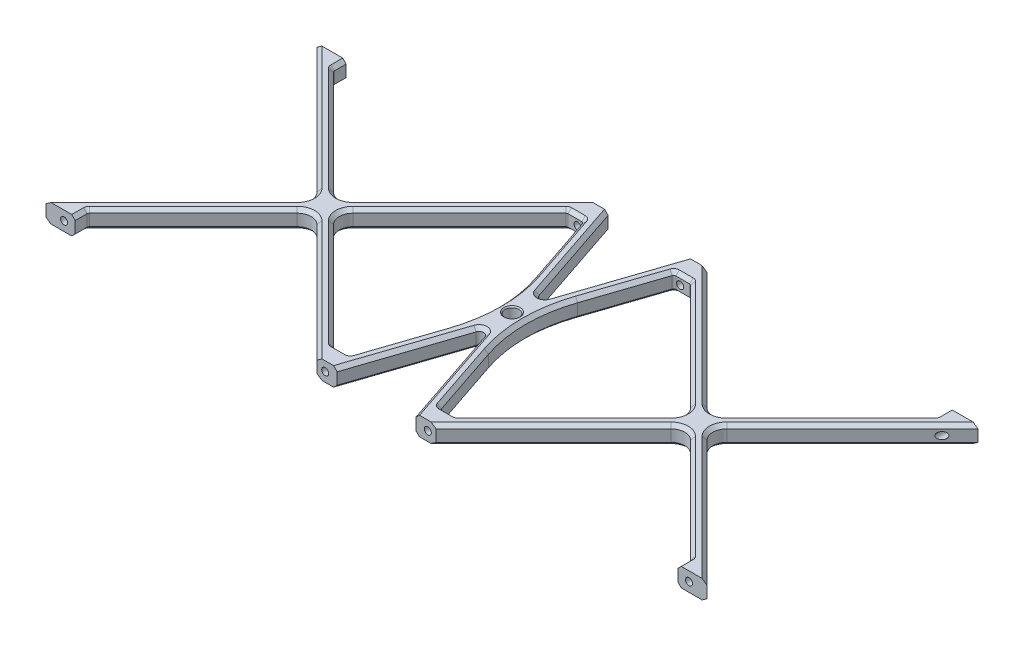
from build123d import *

# Parameters (mm, degrees)
AUFSATZ_LINEAR_AUSTRAGEN1_DEPTH      = 4
AUFSATZ_LINEAR_AUSTRAGEN1_DEPTH_BACK = 4
SKIZZE1_W                            = 284
SKIZZE1_H                            = 116.2
SKIZZE2_R                            = 1.5
SCHNITT_LINEAR_AUSTRAGEN1_DEPTH      = 10
SCHNITT_LINEAR_AUSTRAGEN2_DEPTH      = 154.478369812
SCHNITT_LINEAR_AUSTRAGEN2_DEPTH_BACK = 154.478369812
SKIZZE3_R                            = 1.5
VERRUNDUNG1_R                        = 1
FASE2_SIZE                           = 1.5
SKIZZE4_R                            = 3
SCHNITT_LINEAR_AUSTRAGEN3_DEPTH      = 5
FASE3_SIZE                           = 0.5


with BuildPart() as part:
    # Skizze1 → Aufsatz-Linear austragen1 (new, two sides: drawn at the far end of the back side and taken through both)
    with BuildSketch(Plane(origin=(0, 0, 0), x_dir=(1, 0, 0), z_dir=(0, 1, 0)).offset(-AUFSATZ_LINEAR_AUSTRAGEN1_DEPTH_BACK)):
        Rectangle(SKIZZE1_W, SKIZZE1_H)
    extrude(amount=AUFSATZ_LINEAR_AUSTRAGEN1_DEPTH + AUFSATZ_LINEAR_AUSTRAGEN1_DEPTH_BACK)

    # Skizze2 → Schnitt-Linear austragen1 (cut)
    with BuildSketch(Plane.XY.offset(58.1)):
        with Locations((-134, 0)):
            Circle(SKIZZE2_R)
        with Locations((-22, 0)):
            Circle(SKIZZE2_R)
        with Locations(Location((22, 0, 0), (0, 0, 180))):
            Circle(SKIZZE2_R)
        with Locations(Location((134, 0, 0), (0, 0, 180))):
            Circle(SKIZZE2_R)
    schnitt_linear_austragen1 = extrude(amount=-SCHNITT_LINEAR_AUSTRAGEN1_DEPTH, mode=Mode.SUBTRACT)

    # Spiegeln1: Schnitt-Linear austragen1 across plane
    add(schnitt_linear_austragen1.mirror(Plane.XY), mode=Mode.SUBTRACT)

    # Skizze3 → Schnitt-Linear austragen2 (cut, two sides: drawn at the far end of the back side and taken through both)
    with BuildSketch(Plane(origin=(0, 0, 0), x_dir=(1, 0, 0), z_dir=(0, 1, 0)).offset(-SCHNITT_LINEAR_AUSTRAGEN2_DEPTH_BACK)):
        with Locations(Location((0, 0, 0), (0, 0, 270))):
            Circle(SKIZZE3_R)
        with BuildLine():
            Line((-142, 58.364466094), (-87.878174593, 4.242640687))
            ThreePointArc((-87.878174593, 4.242640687), (-86.12081528, 0), (-87.878174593, -4.242640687))
            Line((-87.878174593, -4.242640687), (-142, -58.364466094))
            Line((-142, -58.364466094), (-142, 58.364466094))
        make_face()
        with BuildLine():
            Line((-129.2, 52.635533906), (-84.342640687, 7.778174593))
            ThreePointArc((-84.342640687, 7.778174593), (-80.1, 6.02081528), (-75.857359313, 7.778174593))
            Line((-75.857359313, 7.778174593), (-25.535533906, 58.1))
            Line((-25.535533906, 58.1), (-129.2, 58.1))
            Line((-129.2, 58.1), (-129.2, 52.635533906))
        make_face()
        with BuildLine():
            Line((-25.535533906, -58.1), (-129.2, -58.1))
            Line((-129.2, -58.1), (-129.2, -52.635533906))
            Line((-129.2, -52.635533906), (-84.342640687, -7.778174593))
            ThreePointArc((-84.342640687, -7.778174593), (-80.1, -6.02081528), (-75.857359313, -7.778174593))
            Line((-75.857359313, -7.778174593), (-25.535533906, -58.1))
        make_face()
        with BuildLine():
            Line((-26.464466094, 50.1), (-72.321825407, 4.242640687))
            ThreePointArc((-72.321825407, 4.242640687), (-74.07918472, 0), (-72.321825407, -4.242640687))
            Line((-72.321825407, -4.242640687), (-26.464466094, -50.1))
            Line((-26.464466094, -50.1), (-19.452025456, -50.1))
            Line((-19.452025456, -50.1), (-9.044566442, -19.091109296))
            ThreePointArc((-9.044566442, -19.091109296), (-5.926281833, 0), (-9.044566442, 19.091109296))
            Line((-9.044566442, 19.091109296), (-19.452025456, 50.1))
            Line((-19.452025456, 50.1), (-26.464466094, 50.1))
        make_face()
        with BuildLine():
            Line((-16.862948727, 58.1), (-1.89605718, 13.506338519))
            ThreePointArc((-1.89605718, 13.506338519), (0, 12.142708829), (1.89605718, 13.506338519))
            Line((1.89605718, 13.506338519), (16.862948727, 58.1))
            Line((16.862948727, 58.1), (-16.862948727, 58.1))
        make_face()
        with BuildLine():
            Line((16.862948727, -58.1), (1.89605718, -13.506338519))
            ThreePointArc((1.89605718, -13.506338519), (0, -12.142708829), (-1.89605718, -13.506338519))
            Line((-1.89605718, -13.506338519), (-16.862948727, -58.1))
            Line((-16.862948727, -58.1), (16.862948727, -58.1))
        make_face()
        with BuildLine():
            Line((26.464466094, -50.1), (72.321825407, -4.242640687))
            ThreePointArc((72.321825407, -4.242640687), (74.07918472, 0), (72.321825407, 4.242640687))
            Line((72.321825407, 4.242640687), (26.464466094, 50.1))
            Line((26.464466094, 50.1), (19.452025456, 50.1))
            Line((19.452025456, 50.1), (9.044566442, 19.091109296))
            ThreePointArc((9.044566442, 19.091109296), (5.926281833, 0), (9.044566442, -19.091109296))
            Line((9.044566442, -19.091109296), (19.452025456, -50.1))
            Line((19.452025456, -50.1), (26.464466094, -50.1))
        make_face()
        with BuildLine():
            Line((75.857359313, -7.778174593), (25.535533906, -58.1))
            Line((25.535533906, -58.1), (129.2, -58.1))
            Line((129.2, -58.1), (129.2, -52.635533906))
            Line((129.2, -52.635533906), (84.342640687, -7.778174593))
            ThreePointArc((84.342640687, -7.778174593), (80.1, -6.02081528), (75.857359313, -7.778174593))
        make_face()
        with BuildLine():
            Line((142, 58.364466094), (142, -58.364466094))
            Line((142, -58.364466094), (87.878174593, -4.242640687))
            ThreePointArc((87.878174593, -4.242640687), (86.12081528, 0), (87.878174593, 4.242640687))
            Line((87.878174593, 4.242640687), (142, 58.364466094))
        make_face()
        with BuildLine():
            Line((75.857359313, 7.778174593), (25.535533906, 58.1))
            Line((25.535533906, 58.1), (129.2, 58.1))
            Line((129.2, 58.1), (129.2, 52.635533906))
            Line((129.2, 52.635533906), (84.342640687, 7.778174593))
            ThreePointArc((84.342640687, 7.778174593), (80.1, 6.02081528), (75.857359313, 7.778174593))
        make_face()
    extrude(amount=SCHNITT_LINEAR_AUSTRAGEN2_DEPTH + SCHNITT_LINEAR_AUSTRAGEN2_DEPTH_BACK, mode=Mode.SUBTRACT)

    # Verrundung1
    verrundung1_edges = [part.edges().sort_by_distance(p)[0] for p in [
        (-19.452025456, 0, 50.1),
        (-26.464466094, 0, -50.1),
        (-19.452025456, 0, -50.1),
        (-26.464466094, 0, 50.1),
        (26.464466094, 0, 50.1),
        (19.452025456, 0, 50.1),
        (19.452025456, 0, -50.1),
        (26.464466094, 0, -50.1),
        (129.2, 0, 52.635533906),
        (-129.2, 0, 52.635533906),
        (-129.2, 0, -52.635533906),
        (129.2, 0, -52.635533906),
    ]]
    fillet(verrundung1_edges, radius=VERRUNDUNG1_R)

    # Fase2
    fase2_edges = [part.edges().sort_by_distance(p)[0] for p in [
        (9.379502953, -4, -35.803169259),
        (0, -4, -12.142708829),
        (-9.379502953, -4, -35.803169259),
        (9.379502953, 4, -35.803169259),
        (-9.379502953, 4, -35.803169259),
        (0, 4, -12.142708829),
        (-14.133877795, -4, -34.254647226),
        (-5.926281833, -4, 0),
        (-49.53959236, -4, 27.024873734),
        (-74.07918472, -4, 0),
        (-74.07918472, 4, 0),
        (-49.53959236, 4, 27.024873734),
        (-5.926281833, 4, 0),
        (-14.133877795, 4, -34.254647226),
        (74.07918472, -4, 0),
        (14.133877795, -4, 34.254647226),
        (5.926281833, -4, 0),
        (49.53959236, -4, -27.024873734),
        (74.07918472, 4, 0),
        (49.53959236, 4, -27.024873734),
        (5.926281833, 4, 0),
        (14.133877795, 4, 34.254647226),
        (0, -4, 12.142708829),
        (9.379502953, -4, 35.803169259),
        (-9.379502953, -4, 35.803169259),
        (0, 4, 12.142708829),
        (-9.379502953, 4, 35.803169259),
        (9.379502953, 4, 35.803169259),
        (129.2, -4, 55.574873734),
        (50.696446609, -4, 32.939087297),
        (80.1, -4, 6.02081528),
        (129.2, 4, 55.574873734),
        (80.1, 4, 6.02081528),
        (50.696446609, 4, 32.939087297),
        (-106.624873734, -4, 30.06040764),
        (-80.1, -4, 6.02081528),
        (-50.696446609, -4, 32.939087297),
        (-50.696446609, 4, 32.939087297),
        (-80.1, 4, 6.02081528),
        (-106.624873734, 4, 30.06040764),
        (-129.2, -4, -55.574873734),
        (-50.696446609, -4, -32.939087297),
        (-80.1, -4, -6.02081528),
        (-129.2, 4, -55.574873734),
        (-80.1, 4, -6.02081528),
        (-50.696446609, 4, -32.939087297),
        (80.1, -4, -6.02081528),
        (50.696446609, -4, -32.939087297),
        (106.624873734, -4, -30.06040764),
        (80.1, 4, -6.02081528),
        (106.624873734, 4, -30.06040764),
        (50.696446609, 4, -32.939087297),
        (114.806854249, -4, 31.171320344),
        (86.12081528, -4, 0),
        (114.806854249, -4, -31.171320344),
        (114.806854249, 4, -31.171320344),
        (86.12081528, 4, 0),
        (114.806854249, 4, 31.171320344),
        (-114.806854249, -4, 31.171320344),
        (-114.806854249, -4, -31.171320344),
        (-86.12081528, -4, 0),
        (-114.806854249, 4, 31.171320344),
        (-86.12081528, 4, 0),
        (-114.806854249, 4, -31.171320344),
        (23.110735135, -4, -50.1),
        (23.110735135, 4, -50.1),
        (14.133877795, -4, -34.254647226),
        (14.133877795, 4, -34.254647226),
        (49.53959236, -4, 27.024873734),
        (49.53959236, 4, 27.024873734),
        (23.110735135, -4, 50.1),
        (23.110735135, 4, 50.1),
        (-14.133877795, -4, 34.254647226),
        (-14.133877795, 4, 34.254647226),
        (-23.110735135, -4, 50.1),
        (-23.110735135, 4, 50.1),
        (-23.110735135, -4, -50.1),
        (-23.110735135, 4, -50.1),
        (-49.53959236, -4, -27.024873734),
        (-49.53959236, 4, -27.024873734),
        (129.2, -4, -55.574873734),
        (129.2, 4, -55.574873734),
        (106.624873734, -4, 30.06040764),
        (106.624873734, 4, 30.06040764),
        (-129.2, -4, 55.574873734),
        (-129.2, 4, 55.574873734),
        (-106.624873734, -4, -30.06040764),
        (-106.624873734, 4, -30.06040764),
        (26.432935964, 4, -50.023879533),
        (26.432935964, -4, -50.023879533),
        (19.587344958, 4, -49.911845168),
        (19.587344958, -4, -49.911845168),
        (26.432935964, 4, 50.023879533),
        (26.432935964, -4, 50.023879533),
        (19.587344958, 4, 49.911845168),
        (19.587344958, -4, 49.911845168),
        (-19.587344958, 4, 49.911845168),
        (-19.587344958, -4, 49.911845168),
        (-26.432935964, 4, 50.023879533),
        (-26.432935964, -4, 50.023879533),
        (-19.587344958, 4, -49.911845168),
        (-19.587344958, -4, -49.911845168),
        (-26.432935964, 4, -50.023879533),
        (-26.432935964, -4, -50.023879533),
        (129.123879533, 4, -52.667064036),
        (129.123879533, -4, -52.667064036),
        (129.123879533, 4, 52.667064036),
        (129.123879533, -4, 52.667064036),
        (-129.123879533, 4, 52.667064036),
        (-129.123879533, -4, 52.667064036),
        (-129.123879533, 4, -52.667064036),
        (-129.123879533, -4, -52.667064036),
    ]]
    chamfer(fase2_edges, length=FASE2_SIZE)

    # Skizze4 → Schnitt-Linear austragen3 (cut)
    with BuildSketch(Plane(origin=(0, 4, 0), x_dir=(1, 0, 0), z_dir=(0, 1, 0))):
        with Locations(Location((0, 0, 0), (0, 0, 270))):
            Circle(SKIZZE4_R)
    extrude(amount=-SCHNITT_LINEAR_AUSTRAGEN3_DEPTH, mode=Mode.SUBTRACT)

    # Fase3
    fase3_edges = [part.edges().sort_by_distance(p)[0] for p in [
        (0, 4, -3),
    ]]
    chamfer(fase3_edges, length=FASE3_SIZE)


solid = part.part
